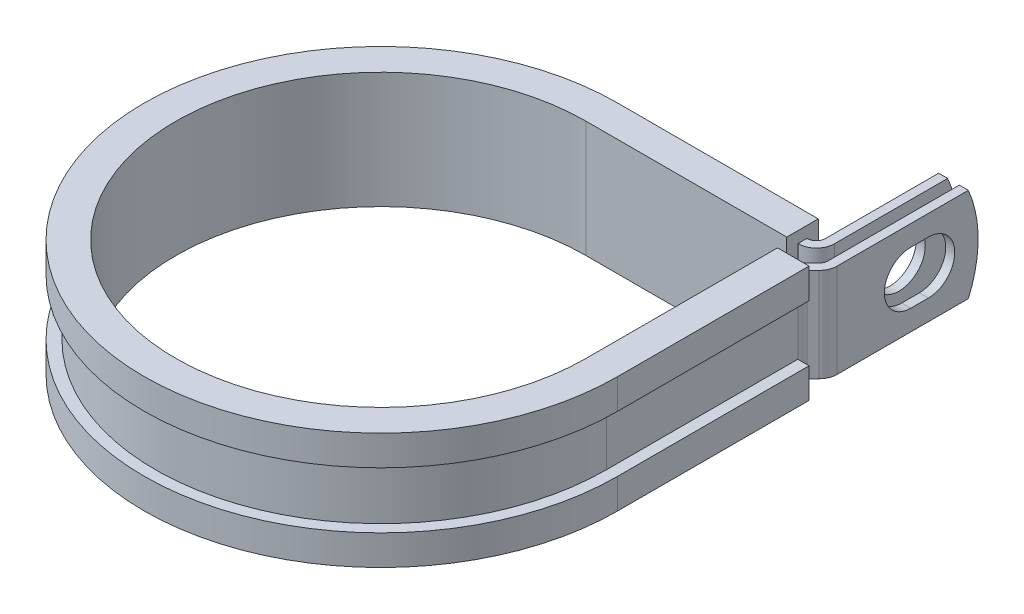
ISO-10303-21;
HEADER;
FILE_DESCRIPTION(('STEP AP214'),'2;1');
FILE_NAME('part.step','',(''),(''),'','','');
FILE_SCHEMA(('AUTOMOTIVE_DESIGN { 1 0 10303 214 1 1 1 1 }'));
ENDSEC;
DATA;
#1=APPLICATION_CONTEXT('core data for automotive mechanical design processes');
#2=APPLICATION_PROTOCOL_DEFINITION('international standard','automotive_design',2000,#1);
#3=PRODUCT_CONTEXT('',#1,'mechanical');
#4=PRODUCT('Part','Part','',(#3));
#5=PRODUCT_RELATED_PRODUCT_CATEGORY('part','',(#4));
#6=PRODUCT_DEFINITION_FORMATION('','',#4);
#7=PRODUCT_DEFINITION_CONTEXT('part definition',#1,'design');
#8=PRODUCT_DEFINITION('design','',#6,#7);
#9=PRODUCT_DEFINITION_SHAPE('','',#8);
#10=(LENGTH_UNIT() NAMED_UNIT(*) SI_UNIT(.MILLI.,.METRE.));
#11=(NAMED_UNIT(*) PLANE_ANGLE_UNIT() SI_UNIT($,.RADIAN.));
#12=(NAMED_UNIT(*) SI_UNIT($,.STERADIAN.) SOLID_ANGLE_UNIT());
#13=UNCERTAINTY_MEASURE_WITH_UNIT(LENGTH_MEASURE(1.E-05),#10,'distance_accuracy_value','');
#14=(GEOMETRIC_REPRESENTATION_CONTEXT(3) GLOBAL_UNCERTAINTY_ASSIGNED_CONTEXT((#13)) GLOBAL_UNIT_ASSIGNED_CONTEXT((#10,
#11,#12)) REPRESENTATION_CONTEXT('',''));
#15=CARTESIAN_POINT('',(0.,0.,0.));
#16=DIRECTION('',(0.,0.,1.));
#17=DIRECTION('',(1.,0.,0.));
#18=AXIS2_PLACEMENT_3D('',#15,#16,#17);
#19=CARTESIAN_POINT('',(29.9771698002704,-6.35,-29.2989));
#20=DIRECTION('',(0.,1.,0.));
#21=DIRECTION('',(1.,0.,0.));
#22=AXIS2_PLACEMENT_3D('',#19,#20,#21);
#23=PLANE('',#22);
#24=DIRECTION('',(0.,0.,-1.));
#25=VECTOR('',#24,1.);
#26=CARTESIAN_POINT('',(27.1323698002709,-6.35,-29.2989));
#27=LINE('',#26,#25);
#28=CARTESIAN_POINT('',(27.1323698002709,-6.35,-29.2989));
#29=VERTEX_POINT('',#28);
#30=CARTESIAN_POINT('',(27.1323698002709,-6.35,-30.5181));
#31=VERTEX_POINT('',#30);
#32=EDGE_CURVE('E524',#29,#31,#27,.T.);
#33=ORIENTED_EDGE('',*,*,#32,.T.);
#34=DIRECTION('',(-1.,0.,0.));
#35=VECTOR('',#34,1.);
#36=CARTESIAN_POINT('',(0.,-6.35,-30.5181));
#37=LINE('',#36,#35);
#38=CARTESIAN_POINT('',(27.1831698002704,-6.35,-30.5181));
#39=VERTEX_POINT('',#38);
#40=EDGE_CURVE('E411',#39,#31,#37,.T.);
#41=ORIENTED_EDGE('',*,*,#40,.F.);
#42=CARTESIAN_POINT('',(27.1831698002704,-6.35,-31.7373));
#43=DIRECTION('',(0.,1.,0.));
#44=DIRECTION('',(1.,0.,0.));
#45=AXIS2_PLACEMENT_3D('',#42,#43,#44);
#46=CIRCLE('',#45,1.2192);
#47=CARTESIAN_POINT('',(28.4023698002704,-6.35,-31.7373));
#48=VERTEX_POINT('',#47);
#49=EDGE_CURVE('E409',#48,#39,#46,.F.);
#50=ORIENTED_EDGE('',*,*,#49,.F.);
#51=DIRECTION('',(0.,0.,1.));
#52=VECTOR('',#51,1.);
#53=CARTESIAN_POINT('',(28.4023698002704,-6.35,-48.387));
#54=LINE('',#53,#52);
#55=CARTESIAN_POINT('',(28.4023698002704,-6.35,-47.0616778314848));
#56=VERTEX_POINT('',#55);
#57=EDGE_CURVE('E407',#56,#48,#54,.T.);
#58=ORIENTED_EDGE('',*,*,#57,.F.);
#59=DIRECTION('',(-1.,0.,0.));
#60=VECTOR('',#59,1.);
#61=CARTESIAN_POINT('',(32.4155698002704,-6.35,-47.0616778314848));
#62=LINE('',#61,#60);
#63=CARTESIAN_POINT('',(29.6215698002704,-6.35,-47.0616778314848));
#64=VERTEX_POINT('',#63);
#65=EDGE_CURVE('E12',#64,#56,#62,.T.);
#66=ORIENTED_EDGE('',*,*,#65,.F.);
#67=DIRECTION('',(0.,0.,1.));
#68=VECTOR('',#67,1.);
#69=CARTESIAN_POINT('',(29.6215698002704,-6.35,-48.387));
#70=LINE('',#69,#68);
#71=CARTESIAN_POINT('',(29.6215698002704,-6.35,-31.7373));
#72=VERTEX_POINT('',#71);
#73=EDGE_CURVE('E405',#64,#72,#70,.T.);
#74=ORIENTED_EDGE('',*,*,#73,.T.);
#75=CARTESIAN_POINT('',(27.1831698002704,-6.35,-31.7373));
#76=DIRECTION('',(0.,-1.,0.));
#77=DIRECTION('',(0.,0.,1.));
#78=AXIS2_PLACEMENT_3D('',#75,#76,#77);
#79=CIRCLE('',#78,2.4384);
#80=CARTESIAN_POINT('',(27.1831698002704,-6.35,-29.2989));
#81=VERTEX_POINT('',#80);
#82=EDGE_CURVE('E402',#72,#81,#79,.T.);
#83=ORIENTED_EDGE('',*,*,#82,.T.);
#84=DIRECTION('',(-1.,0.,0.));
#85=VECTOR('',#84,1.);
#86=CARTESIAN_POINT('',(0.,-6.35,-29.2989));
#87=LINE('',#86,#85);
#88=EDGE_CURVE('E399',#81,#29,#87,.T.);
#89=ORIENTED_EDGE('',*,*,#88,.T.);
#90=EDGE_LOOP('',(#33,#41,#50,#58,#66,#74,#83,#89));
#91=FACE_BOUND('',#90,.T.);
#92=ADVANCED_FACE('F55',(#91),#23,.F.);
#93=CARTESIAN_POINT('',(29.9771698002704,6.35,-29.2989));
#94=DIRECTION('',(0.,1.,0.));
#95=DIRECTION('',(1.,0.,0.));
#96=AXIS2_PLACEMENT_3D('',#93,#94,#95);
#97=PLANE('',#96);
#98=DIRECTION('',(-1.,0.,0.));
#99=VECTOR('',#98,1.);
#100=CARTESIAN_POINT('',(0.,6.35,-30.5181));
#101=LINE('',#100,#99);
#102=CARTESIAN_POINT('',(27.1831698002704,6.35,-30.5181));
#103=VERTEX_POINT('',#102);
#104=CARTESIAN_POINT('',(27.1323698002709,6.35,-30.5181));
#105=VERTEX_POINT('',#104);
#106=EDGE_CURVE('E369',#103,#105,#101,.T.);
#107=ORIENTED_EDGE('',*,*,#106,.T.);
#108=DIRECTION('',(0.,0.,1.));
#109=VECTOR('',#108,1.);
#110=CARTESIAN_POINT('',(27.1323698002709,6.35,-30.5181));
#111=LINE('',#110,#109);
#112=CARTESIAN_POINT('',(27.1323698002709,6.35,-29.2989));
#113=VERTEX_POINT('',#112);
#114=EDGE_CURVE('E518',#105,#113,#111,.T.);
#115=ORIENTED_EDGE('',*,*,#114,.T.);
#116=DIRECTION('',(-1.,0.,0.));
#117=VECTOR('',#116,1.);
#118=CARTESIAN_POINT('',(0.,6.35,-29.2989));
#119=LINE('',#118,#117);
#120=CARTESIAN_POINT('',(27.1831698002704,6.35,-29.2989));
#121=VERTEX_POINT('',#120);
#122=EDGE_CURVE('E626',#121,#113,#119,.T.);
#123=ORIENTED_EDGE('',*,*,#122,.F.);
#124=CARTESIAN_POINT('',(27.1831698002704,6.35,-31.7373));
#125=DIRECTION('',(0.,-1.,0.));
#126=DIRECTION('',(0.,0.,1.));
#127=AXIS2_PLACEMENT_3D('',#124,#125,#126);
#128=CIRCLE('',#127,2.4384);
#129=CARTESIAN_POINT('',(29.6215698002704,6.35,-31.7373));
#130=VERTEX_POINT('',#129);
#131=EDGE_CURVE('E371',#130,#121,#128,.T.);
#132=ORIENTED_EDGE('',*,*,#131,.F.);
#133=DIRECTION('',(0.,0.,1.));
#134=VECTOR('',#133,1.);
#135=CARTESIAN_POINT('',(29.6215698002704,6.35,-48.387));
#136=LINE('',#135,#134);
#137=CARTESIAN_POINT('',(29.6215698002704,6.35,-47.0616778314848));
#138=VERTEX_POINT('',#137);
#139=EDGE_CURVE('E362',#138,#130,#136,.T.);
#140=ORIENTED_EDGE('',*,*,#139,.F.);
#141=DIRECTION('',(-1.,0.,0.));
#142=VECTOR('',#141,1.);
#143=CARTESIAN_POINT('',(32.4155698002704,6.35,-47.0616778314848));
#144=LINE('',#143,#142);
#145=CARTESIAN_POINT('',(28.4023698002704,6.35,-47.0616778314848));
#146=VERTEX_POINT('',#145);
#147=EDGE_CURVE('E63',#138,#146,#144,.T.);
#148=ORIENTED_EDGE('',*,*,#147,.T.);
#149=DIRECTION('',(0.,0.,1.));
#150=VECTOR('',#149,1.);
#151=CARTESIAN_POINT('',(28.4023698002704,6.35,-48.387));
#152=LINE('',#151,#150);
#153=CARTESIAN_POINT('',(28.4023698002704,6.35,-31.7373));
#154=VERTEX_POINT('',#153);
#155=EDGE_CURVE('E359',#146,#154,#152,.T.);
#156=ORIENTED_EDGE('',*,*,#155,.T.);
#157=CARTESIAN_POINT('',(27.1831698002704,6.35,-31.7373));
#158=DIRECTION('',(0.,1.,0.));
#159=DIRECTION('',(1.,0.,0.));
#160=AXIS2_PLACEMENT_3D('',#157,#158,#159);
#161=CIRCLE('',#160,1.2192);
#162=EDGE_CURVE('E367',#154,#103,#161,.F.);
#163=ORIENTED_EDGE('',*,*,#162,.T.);
#164=EDGE_LOOP('',(#107,#115,#123,#132,#140,#148,#156,#163));
#165=FACE_BOUND('',#164,.T.);
#166=ADVANCED_FACE('F358',(#165),#97,.T.);
#167=CARTESIAN_POINT('',(0.,6.35,-29.2989));
#168=DIRECTION('',(0.,0.,1.));
#169=DIRECTION('',(1.,0.,0.));
#170=AXIS2_PLACEMENT_3D('',#167,#168,#169);
#171=PLANE('',#170);
#172=ORIENTED_EDGE('',*,*,#122,.T.);
#173=DIRECTION('',(0.,-1.,0.));
#174=VECTOR('',#173,1.);
#175=CARTESIAN_POINT('',(27.1323698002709,6.35,-29.2989));
#176=LINE('',#175,#174);
#177=EDGE_CURVE('E521',#113,#29,#176,.T.);
#178=ORIENTED_EDGE('',*,*,#177,.T.);
#179=ORIENTED_EDGE('',*,*,#88,.F.);
#180=DIRECTION('',(0.,-1.,0.));
#181=VECTOR('',#180,1.);
#182=CARTESIAN_POINT('',(27.1831698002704,6.35,-29.2989));
#183=LINE('',#182,#181);
#184=EDGE_CURVE('E345',#121,#81,#183,.T.);
#185=ORIENTED_EDGE('',*,*,#184,.F.);
#186=EDGE_LOOP('',(#172,#178,#179,#185));
#187=FACE_BOUND('',#186,.T.);
#188=ADVANCED_FACE('F636',(#187),#171,.T.);
#189=CARTESIAN_POINT('',(32.4155698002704,6.35,-29.2989));
#190=DIRECTION('',(-1.,0.,0.));
#191=DIRECTION('',(0.,0.,1.));
#192=AXIS2_PLACEMENT_3D('',#189,#190,#191);
#193=PLANE('',#192);
#194=CARTESIAN_POINT('',(32.4155698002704,0.,-41.6559999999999));
#195=DIRECTION('',(1.,0.,0.));
#196=DIRECTION('',(0.,0.,-1.));
#197=AXIS2_PLACEMENT_3D('',#194,#195,#196);
#198=CIRCLE('',#197,3.5687);
#199=CARTESIAN_POINT('',(32.4155698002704,-3.5687,-41.6560000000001));
#200=VERTEX_POINT('',#199);
#201=CARTESIAN_POINT('',(32.4155698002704,3.5687,-41.6560000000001));
#202=VERTEX_POINT('',#201);
#203=EDGE_CURVE('E581',#200,#202,#198,.T.);
#204=ORIENTED_EDGE('',*,*,#203,.F.);
#205=DIRECTION('',(0.,0.,-1.));
#206=VECTOR('',#205,1.);
#207=CARTESIAN_POINT('',(32.4155698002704,-3.5687,-39.2683999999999));
#208=LINE('',#207,#206);
#209=CARTESIAN_POINT('',(32.4155698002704,-3.5687,-39.2683999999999));
#210=VERTEX_POINT('',#209);
#211=EDGE_CURVE('E584',#210,#200,#208,.T.);
#212=ORIENTED_EDGE('',*,*,#211,.F.);
#213=CARTESIAN_POINT('',(32.4155698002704,0.,-39.2683999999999));
#214=DIRECTION('',(1.,0.,0.));
#215=DIRECTION('',(0.,0.,-1.));
#216=AXIS2_PLACEMENT_3D('',#213,#214,#215);
#217=CIRCLE('',#216,3.5687);
#218=CARTESIAN_POINT('',(32.4155698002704,3.5687,-39.2683999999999));
#219=VERTEX_POINT('',#218);
#220=EDGE_CURVE('E577',#219,#210,#217,.T.);
#221=ORIENTED_EDGE('',*,*,#220,.F.);
#222=DIRECTION('',(0.,0.,1.));
#223=VECTOR('',#222,1.);
#224=CARTESIAN_POINT('',(32.4155698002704,3.5687,-39.2683999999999));
#225=LINE('',#224,#223);
#226=EDGE_CURVE('E578',#202,#219,#225,.T.);
#227=ORIENTED_EDGE('',*,*,#226,.F.);
#228=EDGE_LOOP('',(#204,#212,#221,#227));
#229=FACE_BOUND('',#228,.T.);
#230=DIRECTION('',(0.,0.,-1.));
#231=VECTOR('',#230,1.);
#232=CARTESIAN_POINT('',(32.4155698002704,-6.35,-29.2989));
#233=LINE('',#232,#231);
#234=CARTESIAN_POINT('',(32.4155698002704,-6.35,-29.2989));
#235=VERTEX_POINT('',#234);
#236=CARTESIAN_POINT('',(32.4155698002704,-6.35,-47.0616778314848));
#237=VERTEX_POINT('',#236);
#238=EDGE_CURVE('E383',#235,#237,#233,.T.);
#239=ORIENTED_EDGE('',*,*,#238,.T.);
#240=CARTESIAN_POINT('',(32.4155698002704,0.,-32.512));
#241=DIRECTION('',(-1.,0.,0.));
#242=DIRECTION('',(0.,0.,1.));
#243=AXIS2_PLACEMENT_3D('',#240,#241,#242);
#244=CIRCLE('',#243,15.875);
#245=CARTESIAN_POINT('',(32.4155698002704,6.35,-47.0616778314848));
#246=VERTEX_POINT('',#245);
#247=EDGE_CURVE('E569',#246,#237,#244,.T.);
#248=ORIENTED_EDGE('',*,*,#247,.F.);
#249=DIRECTION('',(0.,0.,-1.));
#250=VECTOR('',#249,1.);
#251=CARTESIAN_POINT('',(32.4155698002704,6.35,-29.2989));
#252=LINE('',#251,#250);
#253=CARTESIAN_POINT('',(32.4155698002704,6.35,-29.2989));
#254=VERTEX_POINT('',#253);
#255=EDGE_CURVE('E420',#254,#246,#252,.T.);
#256=ORIENTED_EDGE('',*,*,#255,.F.);
#257=DIRECTION('',(0.,-1.,0.));
#258=VECTOR('',#257,1.);
#259=CARTESIAN_POINT('',(32.4155698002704,6.35,-29.2989));
#260=LINE('',#259,#258);
#261=EDGE_CURVE('E382',#254,#235,#260,.T.);
#262=ORIENTED_EDGE('',*,*,#261,.T.);
#263=EDGE_LOOP('',(#239,#248,#256,#262));
#264=FACE_BOUND('',#263,.T.);
#265=ADVANCED_FACE('F57',(#229,#264),#193,.F.);
#266=CARTESIAN_POINT('',(31.1963698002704,6.35,-29.2989));
#267=DIRECTION('',(-1.,0.,0.));
#268=DIRECTION('',(0.,0.,1.));
#269=AXIS2_PLACEMENT_3D('',#266,#267,#268);
#270=PLANE('',#269);
#271=DIRECTION('',(0.,0.,-1.));
#272=VECTOR('',#271,1.);
#273=CARTESIAN_POINT('',(31.1963698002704,-3.5687,-39.2683999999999));
#274=LINE('',#273,#272);
#275=CARTESIAN_POINT('',(31.1963698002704,-3.5687,-39.2683999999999));
#276=VERTEX_POINT('',#275);
#277=CARTESIAN_POINT('',(31.1963698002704,-3.5687,-41.6560000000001));
#278=VERTEX_POINT('',#277);
#279=EDGE_CURVE('E580',#276,#278,#274,.T.);
#280=ORIENTED_EDGE('',*,*,#279,.T.);
#281=CARTESIAN_POINT('',(31.1963698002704,0.,-41.6559999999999));
#282=DIRECTION('',(-1.,0.,0.));
#283=DIRECTION('',(0.,0.,1.));
#284=AXIS2_PLACEMENT_3D('',#281,#282,#283);
#285=CIRCLE('',#284,3.5687);
#286=CARTESIAN_POINT('',(31.1963698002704,3.5687,-41.6560000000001));
#287=VERTEX_POINT('',#286);
#288=EDGE_CURVE('E601',#278,#287,#285,.F.);
#289=ORIENTED_EDGE('',*,*,#288,.T.);
#290=DIRECTION('',(0.,0.,1.));
#291=VECTOR('',#290,1.);
#292=CARTESIAN_POINT('',(31.1963698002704,3.5687,-39.2683999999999));
#293=LINE('',#292,#291);
#294=CARTESIAN_POINT('',(31.1963698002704,3.5687,-39.2683999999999));
#295=VERTEX_POINT('',#294);
#296=EDGE_CURVE('E597',#287,#295,#293,.T.);
#297=ORIENTED_EDGE('',*,*,#296,.T.);
#298=CARTESIAN_POINT('',(31.1963698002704,0.,-39.2683999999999));
#299=DIRECTION('',(-1.,0.,0.));
#300=DIRECTION('',(0.,0.,1.));
#301=AXIS2_PLACEMENT_3D('',#298,#299,#300);
#302=CIRCLE('',#301,3.5687);
#303=EDGE_CURVE('E592',#295,#276,#302,.F.);
#304=ORIENTED_EDGE('',*,*,#303,.T.);
#305=EDGE_LOOP('',(#280,#289,#297,#304));
#306=FACE_BOUND('',#305,.T.);
#307=CARTESIAN_POINT('',(31.1963698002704,0.,-32.512));
#308=DIRECTION('',(-1.,0.,0.));
#309=DIRECTION('',(0.,0.,1.));
#310=AXIS2_PLACEMENT_3D('',#307,#308,#309);
#311=CIRCLE('',#310,15.875);
#312=CARTESIAN_POINT('',(31.1963698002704,6.35,-47.0616778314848));
#313=VERTEX_POINT('',#312);
#314=CARTESIAN_POINT('',(31.1963698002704,-6.35,-47.0616778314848));
#315=VERTEX_POINT('',#314);
#316=EDGE_CURVE('E77',#313,#315,#311,.T.);
#317=ORIENTED_EDGE('',*,*,#316,.T.);
#318=DIRECTION('',(0.,0.,-1.));
#319=VECTOR('',#318,1.);
#320=CARTESIAN_POINT('',(31.1963698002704,-6.35,-29.2989));
#321=LINE('',#320,#319);
#322=CARTESIAN_POINT('',(31.1963698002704,-6.35,-29.2989));
#323=VERTEX_POINT('',#322);
#324=EDGE_CURVE('E386',#323,#315,#321,.T.);
#325=ORIENTED_EDGE('',*,*,#324,.F.);
#326=DIRECTION('',(0.,-1.,0.));
#327=VECTOR('',#326,1.);
#328=CARTESIAN_POINT('',(31.1963698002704,6.35,-29.2989));
#329=LINE('',#328,#327);
#330=CARTESIAN_POINT('',(31.1963698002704,6.35,-29.2989));
#331=VERTEX_POINT('',#330);
#332=EDGE_CURVE('E353',#331,#323,#329,.T.);
#333=ORIENTED_EDGE('',*,*,#332,.F.);
#334=DIRECTION('',(0.,0.,-1.));
#335=VECTOR('',#334,1.);
#336=CARTESIAN_POINT('',(31.1963698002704,6.35,-29.2989));
#337=LINE('',#336,#335);
#338=EDGE_CURVE('E616',#331,#313,#337,.T.);
#339=ORIENTED_EDGE('',*,*,#338,.T.);
#340=EDGE_LOOP('',(#317,#325,#333,#339));
#341=FACE_BOUND('',#340,.T.);
#342=ADVANCED_FACE('F690',(#306,#341),#270,.T.);
#343=CARTESIAN_POINT('',(29.6215698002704,6.35,-48.387));
#344=DIRECTION('',(1.,0.,0.));
#345=DIRECTION('',(0.,0.,-1.));
#346=AXIS2_PLACEMENT_3D('',#343,#344,#345);
#347=PLANE('',#346);
#348=CARTESIAN_POINT('',(29.6215698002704,0.,-40.4622));
#349=DIRECTION('',(1.,0.,0.));
#350=DIRECTION('',(0.,0.,-1.));
#351=AXIS2_PLACEMENT_3D('',#348,#349,#350);
#352=CIRCLE('',#351,3.5687);
#353=CARTESIAN_POINT('',(29.6215698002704,0.,-44.0309));
#354=VERTEX_POINT('',#353);
#355=EDGE_CURVE('E387',#354,#354,#352,.F.);
#356=ORIENTED_EDGE('',*,*,#355,.T.);
#357=EDGE_LOOP('',(#356));
#358=FACE_BOUND('',#357,.T.);
#359=ORIENTED_EDGE('',*,*,#73,.F.);
#360=CARTESIAN_POINT('',(29.6215698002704,0.,-32.512));
#361=DIRECTION('',(1.,0.,0.));
#362=DIRECTION('',(0.,0.,-1.));
#363=AXIS2_PLACEMENT_3D('',#360,#361,#362);
#364=CIRCLE('',#363,15.875);
#365=EDGE_CURVE('E574',#64,#138,#364,.T.);
#366=ORIENTED_EDGE('',*,*,#365,.T.);
#367=ORIENTED_EDGE('',*,*,#139,.T.);
#368=DIRECTION('',(0.,-1.,0.));
#369=VECTOR('',#368,1.);
#370=CARTESIAN_POINT('',(29.6215698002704,6.35,-31.7373));
#371=LINE('',#370,#369);
#372=EDGE_CURVE('E342',#130,#72,#371,.T.);
#373=ORIENTED_EDGE('',*,*,#372,.T.);
#374=EDGE_LOOP('',(#359,#366,#367,#373));
#375=FACE_BOUND('',#374,.T.);
#376=ADVANCED_FACE('F642',(#358,#375),#347,.T.);
#377=CARTESIAN_POINT('',(28.4023698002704,6.35,-48.387));
#378=DIRECTION('',(1.,0.,0.));
#379=DIRECTION('',(0.,0.,-1.));
#380=AXIS2_PLACEMENT_3D('',#377,#378,#379);
#381=PLANE('',#380);
#382=CARTESIAN_POINT('',(28.4023698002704,0.,-40.4622));
#383=DIRECTION('',(-1.,0.,0.));
#384=DIRECTION('',(0.,0.,1.));
#385=AXIS2_PLACEMENT_3D('',#382,#383,#384);
#386=CIRCLE('',#385,3.5687);
#387=CARTESIAN_POINT('',(28.4023698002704,0.,-36.8935));
#388=VERTEX_POINT('',#387);
#389=EDGE_CURVE('E609',#388,#388,#386,.T.);
#390=ORIENTED_EDGE('',*,*,#389,.F.);
#391=EDGE_LOOP('',(#390));
#392=FACE_BOUND('',#391,.T.);
#393=CARTESIAN_POINT('',(28.4023698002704,0.,-32.512));
#394=DIRECTION('',(-1.,0.,0.));
#395=DIRECTION('',(0.,0.,1.));
#396=AXIS2_PLACEMENT_3D('',#393,#394,#395);
#397=CIRCLE('',#396,15.875);
#398=EDGE_CURVE('E69',#146,#56,#397,.T.);
#399=ORIENTED_EDGE('',*,*,#398,.T.);
#400=ORIENTED_EDGE('',*,*,#57,.T.);
#401=DIRECTION('',(0.,-1.,0.));
#402=VECTOR('',#401,1.);
#403=CARTESIAN_POINT('',(28.4023698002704,6.35,-31.7373));
#404=LINE('',#403,#402);
#405=EDGE_CURVE('E339',#154,#48,#404,.T.);
#406=ORIENTED_EDGE('',*,*,#405,.F.);
#407=ORIENTED_EDGE('',*,*,#155,.F.);
#408=EDGE_LOOP('',(#399,#400,#406,#407));
#409=FACE_BOUND('',#408,.T.);
#410=ADVANCED_FACE('F365',(#392,#409),#381,.F.);
#411=CARTESIAN_POINT('',(31.7373,-6.35,-25.8864026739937));
#412=DIRECTION('',(0.,1.,0.));
#413=DIRECTION('',(1.,0.,0.));
#414=AXIS2_PLACEMENT_3D('',#411,#412,#413);
#415=CIRCLE('',#414,1.2192);
#416=CARTESIAN_POINT('',(30.5181,-6.35,-25.8864026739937));
#417=VERTEX_POINT('',#416);
#418=CARTESIAN_POINT('',(30.8751954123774,-6.35,-26.7485072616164));
#419=VERTEX_POINT('',#418);
#420=EDGE_CURVE('E414',#417,#419,#415,.F.);
#421=ORIENTED_EDGE('',*,*,#420,.F.);
#422=DIRECTION('',(1.,0.,0.));
#423=VECTOR('',#422,1.);
#424=CARTESIAN_POINT('',(29.2989,-6.35,-25.8864026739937));
#425=LINE('',#424,#423);
#426=CARTESIAN_POINT('',(29.2989,-6.35,-25.8864026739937));
#427=VERTEX_POINT('',#426);
#428=EDGE_CURVE('E452',#427,#417,#425,.T.);
#429=ORIENTED_EDGE('',*,*,#428,.F.);
#430=CARTESIAN_POINT('',(31.7373,-6.35,-25.8864026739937));
#431=DIRECTION('',(0.,-1.,0.));
#432=DIRECTION('',(0.,0.,1.));
#433=AXIS2_PLACEMENT_3D('',#430,#431,#432);
#434=CIRCLE('',#433,2.4384);
#435=CARTESIAN_POINT('',(30.0130908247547,-6.35,-27.610611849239));
#436=VERTEX_POINT('',#435);
#437=EDGE_CURVE('E396',#427,#436,#434,.T.);
#438=ORIENTED_EDGE('',*,*,#437,.T.);
#439=DIRECTION('',(0.707106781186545,0.,-0.70710678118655));
#440=VECTOR('',#439,1.);
#441=CARTESIAN_POINT('',(30.0130908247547,-6.35,-27.610611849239));
#442=LINE('',#441,#440);
#443=CARTESIAN_POINT('',(30.8392743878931,-6.35,-28.4367954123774));
#444=VERTEX_POINT('',#443);
#445=EDGE_CURVE('E393',#436,#444,#442,.T.);
#446=ORIENTED_EDGE('',*,*,#445,.T.);
#447=CARTESIAN_POINT('',(29.9771698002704,-6.35,-29.2989));
#448=DIRECTION('',(0.,1.,0.));
#449=DIRECTION('',(0.,0.,1.));
#450=AXIS2_PLACEMENT_3D('',#447,#448,#449);
#451=CIRCLE('',#450,1.2192);
#452=EDGE_CURVE('E390',#444,#323,#451,.T.);
#453=ORIENTED_EDGE('',*,*,#452,.T.);
#454=ORIENTED_EDGE('',*,*,#324,.T.);
#455=DIRECTION('',(-1.,0.,0.));
#456=VECTOR('',#455,1.);
#457=CARTESIAN_POINT('',(32.4155698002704,-6.35,-47.0616778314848));
#458=LINE('',#457,#456);
#459=EDGE_CURVE('E567',#237,#315,#458,.T.);
#460=ORIENTED_EDGE('',*,*,#459,.F.);
#461=ORIENTED_EDGE('',*,*,#238,.F.);
#462=CARTESIAN_POINT('',(29.9771698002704,-6.35,-29.2989));
#463=DIRECTION('',(0.,1.,0.));
#464=DIRECTION('',(1.,0.,0.));
#465=AXIS2_PLACEMENT_3D('',#462,#463,#464);
#466=CIRCLE('',#465,2.4384);
#467=CARTESIAN_POINT('',(31.7013789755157,-6.35,-27.5746908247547));
#468=VERTEX_POINT('',#467);
#469=EDGE_CURVE('E418',#468,#235,#466,.T.);
#470=ORIENTED_EDGE('',*,*,#469,.F.);
#471=DIRECTION('',(0.707106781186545,0.,-0.70710678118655));
#472=VECTOR('',#471,1.);
#473=CARTESIAN_POINT('',(30.8751954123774,-6.35,-26.7485072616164));
#474=LINE('',#473,#472);
#475=EDGE_CURVE('E416',#419,#468,#474,.T.);
#476=ORIENTED_EDGE('',*,*,#475,.F.);
#477=EDGE_LOOP('',(#421,#429,#438,#446,#453,#454,#460,#461,#470,#476));
#478=FACE_BOUND('',#477,.T.);
#479=ADVANCED_FACE('F676',(#478),#23,.F.);
#480=DIRECTION('',(-1.,0.,0.));
#481=VECTOR('',#480,1.);
#482=CARTESIAN_POINT('',(30.5181,6.35,-25.8864026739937));
#483=LINE('',#482,#481);
#484=CARTESIAN_POINT('',(30.5181,6.35,-25.8864026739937));
#485=VERTEX_POINT('',#484);
#486=CARTESIAN_POINT('',(29.2989,6.35,-25.8864026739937));
#487=VERTEX_POINT('',#486);
#488=EDGE_CURVE('E441',#485,#487,#483,.T.);
#489=ORIENTED_EDGE('',*,*,#488,.F.);
#490=CARTESIAN_POINT('',(31.7373,6.35,-25.8864026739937));
#491=DIRECTION('',(0.,1.,0.));
#492=DIRECTION('',(1.,0.,0.));
#493=AXIS2_PLACEMENT_3D('',#490,#491,#492);
#494=CIRCLE('',#493,1.2192);
#495=CARTESIAN_POINT('',(30.8751954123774,6.35,-26.7485072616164));
#496=VERTEX_POINT('',#495);
#497=EDGE_CURVE('E376',#485,#496,#494,.F.);
#498=ORIENTED_EDGE('',*,*,#497,.T.);
#499=DIRECTION('',(0.707106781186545,0.,-0.70710678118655));
#500=VECTOR('',#499,1.);
#501=CARTESIAN_POINT('',(30.8751954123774,6.35,-26.7485072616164));
#502=LINE('',#501,#500);
#503=CARTESIAN_POINT('',(31.7013789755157,6.35,-27.5746908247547));
#504=VERTEX_POINT('',#503);
#505=EDGE_CURVE('E378',#496,#504,#502,.T.);
#506=ORIENTED_EDGE('',*,*,#505,.T.);
#507=CARTESIAN_POINT('',(29.9771698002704,6.35,-29.2989));
#508=DIRECTION('',(0.,1.,0.));
#509=DIRECTION('',(1.,0.,0.));
#510=AXIS2_PLACEMENT_3D('',#507,#508,#509);
#511=CIRCLE('',#510,2.4384);
#512=EDGE_CURVE('E380',#504,#254,#511,.T.);
#513=ORIENTED_EDGE('',*,*,#512,.T.);
#514=ORIENTED_EDGE('',*,*,#255,.T.);
#515=DIRECTION('',(-1.,0.,0.));
#516=VECTOR('',#515,1.);
#517=CARTESIAN_POINT('',(32.4155698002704,6.35,-47.0616778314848));
#518=LINE('',#517,#516);
#519=EDGE_CURVE('E571',#246,#313,#518,.T.);
#520=ORIENTED_EDGE('',*,*,#519,.T.);
#521=ORIENTED_EDGE('',*,*,#338,.F.);
#522=CARTESIAN_POINT('',(29.9771698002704,6.35,-29.2989));
#523=DIRECTION('',(0.,1.,0.));
#524=DIRECTION('',(0.,0.,1.));
#525=AXIS2_PLACEMENT_3D('',#522,#523,#524);
#526=CIRCLE('',#525,1.2192);
#527=CARTESIAN_POINT('',(30.8392743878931,6.35,-28.4367954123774));
#528=VERTEX_POINT('',#527);
#529=EDGE_CURVE('E619',#528,#331,#526,.T.);
#530=ORIENTED_EDGE('',*,*,#529,.F.);
#531=DIRECTION('',(0.707106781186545,0.,-0.70710678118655));
#532=VECTOR('',#531,1.);
#533=CARTESIAN_POINT('',(30.0130908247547,6.35,-27.610611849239));
#534=LINE('',#533,#532);
#535=CARTESIAN_POINT('',(30.0130908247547,6.35,-27.610611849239));
#536=VERTEX_POINT('',#535);
#537=EDGE_CURVE('E622',#536,#528,#534,.T.);
#538=ORIENTED_EDGE('',*,*,#537,.F.);
#539=CARTESIAN_POINT('',(31.7373,6.35,-25.8864026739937));
#540=DIRECTION('',(0.,-1.,0.));
#541=DIRECTION('',(0.,0.,1.));
#542=AXIS2_PLACEMENT_3D('',#539,#540,#541);
#543=CIRCLE('',#542,2.4384);
#544=EDGE_CURVE('E451',#487,#536,#543,.T.);
#545=ORIENTED_EDGE('',*,*,#544,.F.);
#546=EDGE_LOOP('',(#489,#498,#506,#513,#514,#520,#521,#530,#538,#545));
#547=FACE_BOUND('',#546,.T.);
#548=ADVANCED_FACE('F448',(#547),#97,.T.);
#549=CARTESIAN_POINT('',(29.9771698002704,6.35,-29.2989));
#550=DIRECTION('',(0.,-1.,0.));
#551=DIRECTION('',(0.,0.,-1.));
#552=AXIS2_PLACEMENT_3D('',#549,#550,#551);
#553=CYLINDRICAL_SURFACE('',#552,1.2192);
#554=ORIENTED_EDGE('',*,*,#452,.F.);
#555=DIRECTION('',(0.,-1.,0.));
#556=VECTOR('',#555,1.);
#557=CARTESIAN_POINT('',(30.8392743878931,6.35,-28.4367954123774));
#558=LINE('',#557,#556);
#559=EDGE_CURVE('E351',#528,#444,#558,.T.);
#560=ORIENTED_EDGE('',*,*,#559,.F.);
#561=ORIENTED_EDGE('',*,*,#529,.T.);
#562=ORIENTED_EDGE('',*,*,#332,.T.);
#563=EDGE_LOOP('',(#554,#560,#561,#562));
#564=FACE_BOUND('',#563,.T.);
#565=ADVANCED_FACE('F686',(#564),#553,.F.);
#566=CARTESIAN_POINT('',(30.0130908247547,6.35,-27.610611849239));
#567=DIRECTION('',(-0.70710678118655,0.,-0.707106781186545));
#568=DIRECTION('',(-0.707106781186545,0.,0.70710678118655));
#569=AXIS2_PLACEMENT_3D('',#566,#567,#568);
#570=PLANE('',#569);
#571=ORIENTED_EDGE('',*,*,#445,.F.);
#572=DIRECTION('',(0.,-1.,0.));
#573=VECTOR('',#572,1.);
#574=CARTESIAN_POINT('',(30.0130908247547,6.35,-27.610611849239));
#575=LINE('',#574,#573);
#576=EDGE_CURVE('E349',#536,#436,#575,.T.);
#577=ORIENTED_EDGE('',*,*,#576,.F.);
#578=ORIENTED_EDGE('',*,*,#537,.T.);
#579=ORIENTED_EDGE('',*,*,#559,.T.);
#580=EDGE_LOOP('',(#571,#577,#578,#579));
#581=FACE_BOUND('',#580,.T.);
#582=ADVANCED_FACE('F681',(#581),#570,.T.);
#583=CARTESIAN_POINT('',(31.7373,6.35,-25.8864026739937));
#584=DIRECTION('',(0.,-1.,0.));
#585=DIRECTION('',(0.,0.,-1.));
#586=AXIS2_PLACEMENT_3D('',#583,#584,#585);
#587=CYLINDRICAL_SURFACE('',#586,2.4384);
#588=ORIENTED_EDGE('',*,*,#437,.F.);
#589=DIRECTION('',(0.,-1.,0.));
#590=VECTOR('',#589,1.);
#591=CARTESIAN_POINT('',(29.2989,6.35,-25.8864026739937));
#592=LINE('',#591,#590);
#593=EDGE_CURVE('E347',#487,#427,#592,.T.);
#594=ORIENTED_EDGE('',*,*,#593,.F.);
#595=ORIENTED_EDGE('',*,*,#544,.T.);
#596=ORIENTED_EDGE('',*,*,#576,.T.);
#597=EDGE_LOOP('',(#588,#594,#595,#596));
#598=FACE_BOUND('',#597,.T.);
#599=ADVANCED_FACE('F678',(#598),#587,.T.);
#600=CARTESIAN_POINT('',(27.1831698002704,6.35,-31.7373));
#601=DIRECTION('',(0.,-1.,0.));
#602=DIRECTION('',(0.,0.,-1.));
#603=AXIS2_PLACEMENT_3D('',#600,#601,#602);
#604=CYLINDRICAL_SURFACE('',#603,2.4384);
#605=ORIENTED_EDGE('',*,*,#82,.F.);
#606=ORIENTED_EDGE('',*,*,#372,.F.);
#607=ORIENTED_EDGE('',*,*,#131,.T.);
#608=ORIENTED_EDGE('',*,*,#184,.T.);
#609=EDGE_LOOP('',(#605,#606,#607,#608));
#610=FACE_BOUND('',#609,.T.);
#611=ADVANCED_FACE('F632',(#610),#604,.T.);
#612=CARTESIAN_POINT('',(27.1831698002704,6.35,-31.7373));
#613=DIRECTION('',(0.,-1.,0.));
#614=DIRECTION('',(0.,0.,-1.));
#615=AXIS2_PLACEMENT_3D('',#612,#613,#614);
#616=CYLINDRICAL_SURFACE('',#615,1.2192);
#617=ORIENTED_EDGE('',*,*,#49,.T.);
#618=DIRECTION('',(0.,-1.,0.));
#619=VECTOR('',#618,1.);
#620=CARTESIAN_POINT('',(27.1831698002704,6.35,-30.5181));
#621=LINE('',#620,#619);
#622=EDGE_CURVE('E330',#103,#39,#621,.T.);
#623=ORIENTED_EDGE('',*,*,#622,.F.);
#624=ORIENTED_EDGE('',*,*,#162,.F.);
#625=ORIENTED_EDGE('',*,*,#405,.T.);
#626=EDGE_LOOP('',(#617,#623,#624,#625));
#627=FACE_BOUND('',#626,.T.);
#628=ADVANCED_FACE('F647',(#627),#616,.F.);
#629=CARTESIAN_POINT('',(0.,6.35,-30.5181));
#630=DIRECTION('',(0.,0.,1.));
#631=DIRECTION('',(1.,0.,0.));
#632=AXIS2_PLACEMENT_3D('',#629,#630,#631);
#633=PLANE('',#632);
#634=DIRECTION('',(0.,-1.,0.));
#635=VECTOR('',#634,1.);
#636=CARTESIAN_POINT('',(0.,6.35,-30.5181));
#637=LINE('',#636,#635);
#638=CARTESIAN_POINT('',(4.28082201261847E-13,3.81,-30.5181));
#639=VERTEX_POINT('',#638);
#640=CARTESIAN_POINT('',(4.28082201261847E-13,-3.81,-30.5181));
#641=VERTEX_POINT('',#640);
#642=EDGE_CURVE('E321',#639,#641,#637,.T.);
#643=ORIENTED_EDGE('',*,*,#642,.F.);
#644=DIRECTION('',(1.,0.,0.));
#645=VECTOR('',#644,1.);
#646=CARTESIAN_POINT('',(4.28082201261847E-13,3.81,-30.5181));
#647=LINE('',#646,#645);
#648=CARTESIAN_POINT('',(27.1323698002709,3.81,-30.5181));
#649=VERTEX_POINT('',#648);
#650=EDGE_CURVE('E564',#639,#649,#647,.T.);
#651=ORIENTED_EDGE('',*,*,#650,.T.);
#652=DIRECTION('',(0.,1.,0.));
#653=VECTOR('',#652,1.);
#654=CARTESIAN_POINT('',(27.1323698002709,6.35,-30.5181));
#655=LINE('',#654,#653);
#656=EDGE_CURVE('E515',#649,#105,#655,.T.);
#657=ORIENTED_EDGE('',*,*,#656,.T.);
#658=ORIENTED_EDGE('',*,*,#106,.F.);
#659=ORIENTED_EDGE('',*,*,#622,.T.);
#660=ORIENTED_EDGE('',*,*,#40,.T.);
#661=DIRECTION('',(0.,1.,0.));
#662=VECTOR('',#661,1.);
#663=CARTESIAN_POINT('',(27.1323698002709,-6.35,-30.5181));
#664=LINE('',#663,#662);
#665=CARTESIAN_POINT('',(27.1323698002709,-3.81,-30.5181));
#666=VERTEX_POINT('',#665);
#667=EDGE_CURVE('E527',#31,#666,#664,.T.);
#668=ORIENTED_EDGE('',*,*,#667,.T.);
#669=DIRECTION('',(1.,0.,0.));
#670=VECTOR('',#669,1.);
#671=CARTESIAN_POINT('',(4.28082201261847E-13,-3.81,-30.5181));
#672=LINE('',#671,#670);
#673=EDGE_CURVE('E544',#641,#666,#672,.T.);
#674=ORIENTED_EDGE('',*,*,#673,.F.);
#675=EDGE_LOOP('',(#643,#651,#657,#658,#659,#660,#668,#674));
#676=FACE_BOUND('',#675,.T.);
#677=ADVANCED_FACE('F651',(#676),#633,.F.);
#678=CARTESIAN_POINT('',(0.,6.35,0.));
#679=DIRECTION('',(0.,-1.,0.));
#680=DIRECTION('',(0.,0.,-1.));
#681=AXIS2_PLACEMENT_3D('',#678,#679,#680);
#682=CYLINDRICAL_SURFACE('',#681,30.5181);
#683=DIRECTION('',(0.,-1.,0.));
#684=VECTOR('',#683,1.);
#685=CARTESIAN_POINT('',(30.5181,6.35,0.));
#686=LINE('',#685,#684);
#687=CARTESIAN_POINT('',(30.5181,3.81,0.));
#688=VERTEX_POINT('',#687);
#689=CARTESIAN_POINT('',(30.5181,-3.81,0.));
#690=VERTEX_POINT('',#689);
#691=EDGE_CURVE('E319',#688,#690,#686,.T.);
#692=ORIENTED_EDGE('',*,*,#691,.F.);
#693=CARTESIAN_POINT('',(0.,3.81,0.));
#694=DIRECTION('',(0.,-1.,0.));
#695=DIRECTION('',(0.,0.,-1.));
#696=AXIS2_PLACEMENT_3D('',#693,#694,#695);
#697=CIRCLE('',#696,30.5181);
#698=EDGE_CURVE('E513',#688,#639,#697,.T.);
#699=ORIENTED_EDGE('',*,*,#698,.T.);
#700=ORIENTED_EDGE('',*,*,#642,.T.);
#701=CARTESIAN_POINT('',(0.,-3.81,0.));
#702=DIRECTION('',(0.,-1.,0.));
#703=DIRECTION('',(0.,0.,-1.));
#704=AXIS2_PLACEMENT_3D('',#701,#702,#703);
#705=CIRCLE('',#704,30.5181);
#706=EDGE_CURVE('E302',#690,#641,#705,.T.);
#707=ORIENTED_EDGE('',*,*,#706,.F.);
#708=EDGE_LOOP('',(#692,#699,#700,#707));
#709=FACE_BOUND('',#708,.T.);
#710=ADVANCED_FACE('F317',(#709),#682,.T.);
#711=CARTESIAN_POINT('',(30.5181,6.35,0.));
#712=DIRECTION('',(-1.,0.,0.));
#713=DIRECTION('',(0.,0.,1.));
#714=AXIS2_PLACEMENT_3D('',#711,#712,#713);
#715=PLANE('',#714);
#716=DIRECTION('',(0.,-1.,0.));
#717=VECTOR('',#716,1.);
#718=CARTESIAN_POINT('',(30.5181,6.35,-25.8864026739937));
#719=LINE('',#718,#717);
#720=CARTESIAN_POINT('',(30.5181,3.81,-25.8864026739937));
#721=VERTEX_POINT('',#720);
#722=CARTESIAN_POINT('',(30.5181,-3.81,-25.8864026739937));
#723=VERTEX_POINT('',#722);
#724=EDGE_CURVE('E333',#721,#723,#719,.T.);
#725=ORIENTED_EDGE('',*,*,#724,.F.);
#726=DIRECTION('',(0.,0.,-1.));
#727=VECTOR('',#726,1.);
#728=CARTESIAN_POINT('',(30.5181,3.81,0.));
#729=LINE('',#728,#727);
#730=EDGE_CURVE('E327',#688,#721,#729,.T.);
#731=ORIENTED_EDGE('',*,*,#730,.F.);
#732=ORIENTED_EDGE('',*,*,#691,.T.);
#733=DIRECTION('',(0.,0.,-1.));
#734=VECTOR('',#733,1.);
#735=CARTESIAN_POINT('',(30.5181,-3.81,0.));
#736=LINE('',#735,#734);
#737=EDGE_CURVE('E298',#690,#723,#736,.T.);
#738=ORIENTED_EDGE('',*,*,#737,.T.);
#739=EDGE_LOOP('',(#725,#731,#732,#738));
#740=FACE_BOUND('',#739,.T.);
#741=ADVANCED_FACE('F326',(#740),#715,.F.);
#742=CARTESIAN_POINT('',(31.7373,6.35,-25.8864026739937));
#743=DIRECTION('',(0.,-1.,0.));
#744=DIRECTION('',(0.,0.,-1.));
#745=AXIS2_PLACEMENT_3D('',#742,#743,#744);
#746=CYLINDRICAL_SURFACE('',#745,1.2192);
#747=ORIENTED_EDGE('',*,*,#420,.T.);
#748=DIRECTION('',(0.,-1.,0.));
#749=VECTOR('',#748,1.);
#750=CARTESIAN_POINT('',(30.8751954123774,6.35,-26.7485072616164));
#751=LINE('',#750,#749);
#752=EDGE_CURVE('E425',#496,#419,#751,.T.);
#753=ORIENTED_EDGE('',*,*,#752,.F.);
#754=ORIENTED_EDGE('',*,*,#497,.F.);
#755=EDGE_CURVE('E328',#485,#721,#719,.T.);
#756=ORIENTED_EDGE('',*,*,#755,.T.);
#757=ORIENTED_EDGE('',*,*,#724,.T.);
#758=DIRECTION('',(0.,1.,0.));
#759=VECTOR('',#758,1.);
#760=CARTESIAN_POINT('',(30.5181,-6.35,-25.8864026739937));
#761=LINE('',#760,#759);
#762=EDGE_CURVE('E434',#417,#723,#761,.T.);
#763=ORIENTED_EDGE('',*,*,#762,.F.);
#764=EDGE_LOOP('',(#747,#753,#754,#756,#757,#763));
#765=FACE_BOUND('',#764,.T.);
#766=ADVANCED_FACE('F433',(#765),#746,.F.);
#767=CARTESIAN_POINT('',(30.8751954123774,6.35,-26.7485072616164));
#768=DIRECTION('',(-0.70710678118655,0.,-0.707106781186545));
#769=DIRECTION('',(-0.707106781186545,0.,0.70710678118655));
#770=AXIS2_PLACEMENT_3D('',#767,#768,#769);
#771=PLANE('',#770);
#772=ORIENTED_EDGE('',*,*,#475,.T.);
#773=DIRECTION('',(0.,-1.,0.));
#774=VECTOR('',#773,1.);
#775=CARTESIAN_POINT('',(31.7013789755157,6.35,-27.5746908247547));
#776=LINE('',#775,#774);
#777=EDGE_CURVE('E423',#504,#468,#776,.T.);
#778=ORIENTED_EDGE('',*,*,#777,.F.);
#779=ORIENTED_EDGE('',*,*,#505,.F.);
#780=ORIENTED_EDGE('',*,*,#752,.T.);
#781=EDGE_LOOP('',(#772,#778,#779,#780));
#782=FACE_BOUND('',#781,.T.);
#783=ADVANCED_FACE('F702',(#782),#771,.F.);
#784=CARTESIAN_POINT('',(29.9771698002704,6.35,-29.2989));
#785=DIRECTION('',(0.,-1.,0.));
#786=DIRECTION('',(0.,0.,-1.));
#787=AXIS2_PLACEMENT_3D('',#784,#785,#786);
#788=CYLINDRICAL_SURFACE('',#787,2.4384);
#789=ORIENTED_EDGE('',*,*,#469,.T.);
#790=ORIENTED_EDGE('',*,*,#261,.F.);
#791=ORIENTED_EDGE('',*,*,#512,.F.);
#792=ORIENTED_EDGE('',*,*,#777,.T.);
#793=EDGE_LOOP('',(#789,#790,#791,#792));
#794=FACE_BOUND('',#793,.T.);
#795=ADVANCED_FACE('F700',(#794),#788,.T.);
#796=CARTESIAN_POINT('',(39.7153776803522,0.,-40.4622));
#797=DIRECTION('',(-1.,0.,0.));
#798=DIRECTION('',(0.,0.,1.));
#799=AXIS2_PLACEMENT_3D('',#796,#797,#798);
#800=CYLINDRICAL_SURFACE('',#799,3.5687);
#801=ORIENTED_EDGE('',*,*,#389,.T.);
#802=EDGE_LOOP('',(#801));
#803=FACE_BOUND('',#802,.T.);
#804=ORIENTED_EDGE('',*,*,#355,.F.);
#805=EDGE_LOOP('',(#804));
#806=FACE_BOUND('',#805,.T.);
#807=ADVANCED_FACE('F709',(#803,#806),#800,.F.);
#808=CARTESIAN_POINT('',(19.2939287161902,-3.5687,-39.2683999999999));
#809=DIRECTION('',(0.,-1.,0.));
#810=DIRECTION('',(0.,0.,-1.));
#811=AXIS2_PLACEMENT_3D('',#808,#809,#810);
#812=PLANE('',#811);
#813=DIRECTION('',(1.,0.,0.));
#814=VECTOR('',#813,1.);
#815=CARTESIAN_POINT('',(19.2939287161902,-3.5687,-39.2683999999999));
#816=LINE('',#815,#814);
#817=EDGE_CURVE('E595',#276,#210,#816,.T.);
#818=ORIENTED_EDGE('',*,*,#817,.T.);
#819=ORIENTED_EDGE('',*,*,#211,.T.);
#820=DIRECTION('',(1.,0.,0.));
#821=VECTOR('',#820,1.);
#822=CARTESIAN_POINT('',(19.2939287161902,-3.5687,-41.6560000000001));
#823=LINE('',#822,#821);
#824=EDGE_CURVE('E591',#278,#200,#823,.T.);
#825=ORIENTED_EDGE('',*,*,#824,.F.);
#826=ORIENTED_EDGE('',*,*,#279,.F.);
#827=EDGE_LOOP('',(#818,#819,#825,#826));
#828=FACE_BOUND('',#827,.T.);
#829=ADVANCED_FACE('F752',(#828),#812,.F.);
#830=CARTESIAN_POINT('',(19.2939287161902,0.,-41.6559999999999));
#831=DIRECTION('',(1.,0.,0.));
#832=DIRECTION('',(0.,0.,-1.));
#833=AXIS2_PLACEMENT_3D('',#830,#831,#832);
#834=CYLINDRICAL_SURFACE('',#833,3.5687);
#835=ORIENTED_EDGE('',*,*,#824,.T.);
#836=ORIENTED_EDGE('',*,*,#203,.T.);
#837=DIRECTION('',(1.,0.,0.));
#838=VECTOR('',#837,1.);
#839=CARTESIAN_POINT('',(19.2939287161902,3.5687,-41.6560000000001));
#840=LINE('',#839,#838);
#841=EDGE_CURVE('E600',#287,#202,#840,.T.);
#842=ORIENTED_EDGE('',*,*,#841,.F.);
#843=ORIENTED_EDGE('',*,*,#288,.F.);
#844=EDGE_LOOP('',(#835,#836,#842,#843));
#845=FACE_BOUND('',#844,.T.);
#846=ADVANCED_FACE('F756',(#845),#834,.F.);
#847=CARTESIAN_POINT('',(19.2939287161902,3.5687,-39.2683999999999));
#848=DIRECTION('',(0.,1.,0.));
#849=DIRECTION('',(0.,0.,1.));
#850=AXIS2_PLACEMENT_3D('',#847,#848,#849);
#851=PLANE('',#850);
#852=ORIENTED_EDGE('',*,*,#841,.T.);
#853=ORIENTED_EDGE('',*,*,#226,.T.);
#854=DIRECTION('',(1.,0.,0.));
#855=VECTOR('',#854,1.);
#856=CARTESIAN_POINT('',(19.2939287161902,3.5687,-39.2683999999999));
#857=LINE('',#856,#855);
#858=EDGE_CURVE('E596',#295,#219,#857,.T.);
#859=ORIENTED_EDGE('',*,*,#858,.F.);
#860=ORIENTED_EDGE('',*,*,#296,.F.);
#861=EDGE_LOOP('',(#852,#853,#859,#860));
#862=FACE_BOUND('',#861,.T.);
#863=ADVANCED_FACE('F760',(#862),#851,.F.);
#864=CARTESIAN_POINT('',(19.2939287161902,0.,-39.2683999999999));
#865=DIRECTION('',(1.,0.,0.));
#866=DIRECTION('',(0.,0.,-1.));
#867=AXIS2_PLACEMENT_3D('',#864,#865,#866);
#868=CYLINDRICAL_SURFACE('',#867,3.5687);
#869=ORIENTED_EDGE('',*,*,#858,.T.);
#870=ORIENTED_EDGE('',*,*,#220,.T.);
#871=ORIENTED_EDGE('',*,*,#817,.F.);
#872=ORIENTED_EDGE('',*,*,#303,.F.);
#873=EDGE_LOOP('',(#869,#870,#871,#872));
#874=FACE_BOUND('',#873,.T.);
#875=ADVANCED_FACE('F764',(#874),#868,.F.);
#876=CARTESIAN_POINT('',(32.4155698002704,0.,-32.512));
#877=DIRECTION('',(-1.,0.,0.));
#878=DIRECTION('',(0.,0.,1.));
#879=AXIS2_PLACEMENT_3D('',#876,#877,#878);
#880=CYLINDRICAL_SURFACE('',#879,15.875);
#881=ORIENTED_EDGE('',*,*,#365,.F.);
#882=ORIENTED_EDGE('',*,*,#65,.T.);
#883=ORIENTED_EDGE('',*,*,#398,.F.);
#884=ORIENTED_EDGE('',*,*,#147,.F.);
#885=EDGE_LOOP('',(#881,#882,#883,#884));
#886=FACE_BOUND('',#885,.T.);
#887=ADVANCED_FACE('F643',(#886),#880,.T.);
#888=ORIENTED_EDGE('',*,*,#519,.F.);
#889=ORIENTED_EDGE('',*,*,#247,.T.);
#890=ORIENTED_EDGE('',*,*,#459,.T.);
#891=ORIENTED_EDGE('',*,*,#316,.F.);
#892=EDGE_LOOP('',(#888,#889,#890,#891));
#893=FACE_BOUND('',#892,.T.);
#894=ADVANCED_FACE('F691',(#893),#880,.T.);
#895=CARTESIAN_POINT('',(4.4945958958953E-13,7.874,-32.0421));
#896=DIRECTION('',(0.,0.,1.));
#897=DIRECTION('',(1.,0.,0.));
#898=AXIS2_PLACEMENT_3D('',#895,#896,#897);
#899=PLANE('',#898);
#900=DIRECTION('',(0.,-1.,0.));
#901=VECTOR('',#900,1.);
#902=CARTESIAN_POINT('',(4.4945958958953E-13,7.874,-32.0421));
#903=LINE('',#902,#901);
#904=CARTESIAN_POINT('',(4.4945958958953E-13,7.874,-32.0421));
#905=VERTEX_POINT('',#904);
#906=CARTESIAN_POINT('',(4.4945958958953E-13,3.81,-32.0421));
#907=VERTEX_POINT('',#906);
#908=EDGE_CURVE('E323',#905,#907,#903,.T.);
#909=ORIENTED_EDGE('',*,*,#908,.F.);
#910=DIRECTION('',(1.,0.,0.));
#911=VECTOR('',#910,1.);
#912=CARTESIAN_POINT('',(4.4945958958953E-13,7.874,-32.0421));
#913=LINE('',#912,#911);
#914=CARTESIAN_POINT('',(27.1323698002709,7.874,-32.0421));
#915=VERTEX_POINT('',#914);
#916=EDGE_CURVE('E558',#905,#915,#913,.T.);
#917=ORIENTED_EDGE('',*,*,#916,.T.);
#918=DIRECTION('',(0.,-1.,0.));
#919=VECTOR('',#918,1.);
#920=CARTESIAN_POINT('',(27.1323698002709,7.874,-32.0421));
#921=LINE('',#920,#919);
#922=CARTESIAN_POINT('',(27.1323698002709,3.81,-32.0421));
#923=VERTEX_POINT('',#922);
#924=EDGE_CURVE('E540',#915,#923,#921,.T.);
#925=ORIENTED_EDGE('',*,*,#924,.T.);
#926=DIRECTION('',(1.,0.,0.));
#927=VECTOR('',#926,1.);
#928=CARTESIAN_POINT('',(4.4945958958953E-13,3.81,-32.0421));
#929=LINE('',#928,#927);
#930=EDGE_CURVE('E561',#907,#923,#929,.T.);
#931=ORIENTED_EDGE('',*,*,#930,.F.);
#932=EDGE_LOOP('',(#909,#917,#925,#931));
#933=FACE_BOUND('',#932,.T.);
#934=ADVANCED_FACE('F855',(#933),#899,.F.);
#935=CARTESIAN_POINT('',(3.89602902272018E-13,7.874,-27.7749));
#936=DIRECTION('',(0.,0.,-1.));
#937=DIRECTION('',(0.,1.,0.));
#938=AXIS2_PLACEMENT_3D('',#935,#936,#937);
#939=PLANE('',#938);
#940=DIRECTION('',(0.,1.,0.));
#941=VECTOR('',#940,1.);
#942=CARTESIAN_POINT('',(3.89602902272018E-13,7.874,-27.7749));
#943=LINE('',#942,#941);
#944=CARTESIAN_POINT('',(3.89602902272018E-13,-7.874,-27.7749));
#945=VERTEX_POINT('',#944);
#946=CARTESIAN_POINT('',(3.89602902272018E-13,7.874,-27.7749));
#947=VERTEX_POINT('',#946);
#948=EDGE_CURVE('E491',#945,#947,#943,.T.);
#949=ORIENTED_EDGE('',*,*,#948,.F.);
#950=DIRECTION('',(1.,0.,0.));
#951=VECTOR('',#950,1.);
#952=CARTESIAN_POINT('',(3.89602902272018E-13,-7.874,-27.7749));
#953=LINE('',#952,#951);
#954=CARTESIAN_POINT('',(27.1323698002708,-7.874,-27.7749));
#955=VERTEX_POINT('',#954);
#956=EDGE_CURVE('E552',#945,#955,#953,.T.);
#957=ORIENTED_EDGE('',*,*,#956,.T.);
#958=DIRECTION('',(0.,1.,0.));
#959=VECTOR('',#958,1.);
#960=CARTESIAN_POINT('',(27.1323698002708,7.874,-27.7749));
#961=LINE('',#960,#959);
#962=CARTESIAN_POINT('',(27.1323698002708,7.874,-27.7749));
#963=VERTEX_POINT('',#962);
#964=EDGE_CURVE('E536',#955,#963,#961,.T.);
#965=ORIENTED_EDGE('',*,*,#964,.T.);
#966=DIRECTION('',(1.,0.,0.));
#967=VECTOR('',#966,1.);
#968=CARTESIAN_POINT('',(3.89602902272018E-13,7.874,-27.7749));
#969=LINE('',#968,#967);
#970=EDGE_CURVE('E555',#947,#963,#969,.T.);
#971=ORIENTED_EDGE('',*,*,#970,.F.);
#972=EDGE_LOOP('',(#949,#957,#965,#971));
#973=FACE_BOUND('',#972,.T.);
#974=ADVANCED_FACE('F941',(#973),#939,.F.);
#975=CARTESIAN_POINT('',(4.4945958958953E-13,-7.874,-32.0421));
#976=DIRECTION('',(0.,0.,1.));
#977=DIRECTION('',(1.,0.,0.));
#978=AXIS2_PLACEMENT_3D('',#975,#976,#977);
#979=PLANE('',#978);
#980=DIRECTION('',(0.,-1.,0.));
#981=VECTOR('',#980,1.);
#982=CARTESIAN_POINT('',(4.4945958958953E-13,-7.874,-32.0421));
#983=LINE('',#982,#981);
#984=CARTESIAN_POINT('',(4.4945958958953E-13,-3.81,-32.0421));
#985=VERTEX_POINT('',#984);
#986=CARTESIAN_POINT('',(4.4945958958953E-13,-7.874,-32.0421));
#987=VERTEX_POINT('',#986);
#988=EDGE_CURVE('E477',#985,#987,#983,.T.);
#989=ORIENTED_EDGE('',*,*,#988,.F.);
#990=DIRECTION('',(1.,0.,0.));
#991=VECTOR('',#990,1.);
#992=CARTESIAN_POINT('',(4.4945958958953E-13,-3.81,-32.0421));
#993=LINE('',#992,#991);
#994=CARTESIAN_POINT('',(27.1323698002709,-3.81,-32.0421));
#995=VERTEX_POINT('',#994);
#996=EDGE_CURVE('E546',#985,#995,#993,.T.);
#997=ORIENTED_EDGE('',*,*,#996,.T.);
#998=DIRECTION('',(0.,-1.,0.));
#999=VECTOR('',#998,1.);
#1000=CARTESIAN_POINT('',(27.1323698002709,-7.874,-32.0421));
#1001=LINE('',#1000,#999);
#1002=CARTESIAN_POINT('',(27.1323698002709,-7.874,-32.0421));
#1003=VERTEX_POINT('',#1002);
#1004=EDGE_CURVE('E532',#995,#1003,#1001,.T.);
#1005=ORIENTED_EDGE('',*,*,#1004,.T.);
#1006=DIRECTION('',(1.,0.,0.));
#1007=VECTOR('',#1006,1.);
#1008=CARTESIAN_POINT('',(4.4945958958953E-13,-7.874,-32.0421));
#1009=LINE('',#1008,#1007);
#1010=EDGE_CURVE('E549',#987,#1003,#1009,.T.);
#1011=ORIENTED_EDGE('',*,*,#1010,.F.);
#1012=EDGE_LOOP('',(#989,#997,#1005,#1011));
#1013=FACE_BOUND('',#1012,.T.);
#1014=ADVANCED_FACE('F662',(#1013),#979,.F.);
#1015=CARTESIAN_POINT('',(0.,6.35,0.));
#1016=DIRECTION('',(0.,-1.,0.));
#1017=DIRECTION('',(0.,0.,-1.));
#1018=AXIS2_PLACEMENT_3D('',#1015,#1016,#1017);
#1019=CYLINDRICAL_SURFACE('',#1018,32.0421);
#1020=DIRECTION('',(0.,-1.,0.));
#1021=VECTOR('',#1020,1.);
#1022=CARTESIAN_POINT('',(32.0421,7.874,0.));
#1023=LINE('',#1022,#1021);
#1024=CARTESIAN_POINT('',(32.0421,7.874,0.));
#1025=VERTEX_POINT('',#1024);
#1026=CARTESIAN_POINT('',(32.0421,3.81,0.));
#1027=VERTEX_POINT('',#1026);
#1028=EDGE_CURVE('E312',#1025,#1027,#1023,.T.);
#1029=ORIENTED_EDGE('',*,*,#1028,.F.);
#1030=CARTESIAN_POINT('',(0.,7.874,0.));
#1031=DIRECTION('',(0.,-1.,0.));
#1032=DIRECTION('',(0.,0.,-1.));
#1033=AXIS2_PLACEMENT_3D('',#1030,#1031,#1032);
#1034=CIRCLE('',#1033,32.0421);
#1035=EDGE_CURVE('E507',#1025,#905,#1034,.T.);
#1036=ORIENTED_EDGE('',*,*,#1035,.T.);
#1037=ORIENTED_EDGE('',*,*,#908,.T.);
#1038=CARTESIAN_POINT('',(0.,3.81,0.));
#1039=DIRECTION('',(0.,-1.,0.));
#1040=DIRECTION('',(0.,0.,-1.));
#1041=AXIS2_PLACEMENT_3D('',#1038,#1039,#1040);
#1042=CIRCLE('',#1041,32.0421);
#1043=EDGE_CURVE('E510',#1027,#907,#1042,.T.);
#1044=ORIENTED_EDGE('',*,*,#1043,.F.);
#1045=EDGE_LOOP('',(#1029,#1036,#1037,#1044));
#1046=FACE_BOUND('',#1045,.T.);
#1047=ADVANCED_FACE('F961',(#1046),#1019,.T.);
#1048=CARTESIAN_POINT('',(0.,6.35,0.));
#1049=DIRECTION('',(0.,-1.,0.));
#1050=DIRECTION('',(0.,0.,-1.));
#1051=AXIS2_PLACEMENT_3D('',#1048,#1049,#1050);
#1052=CYLINDRICAL_SURFACE('',#1051,27.7749);
#1053=DIRECTION('',(0.,1.,0.));
#1054=VECTOR('',#1053,1.);
#1055=CARTESIAN_POINT('',(27.7749,7.874,0.));
#1056=LINE('',#1055,#1054);
#1057=CARTESIAN_POINT('',(27.7749,-7.874,0.));
#1058=VERTEX_POINT('',#1057);
#1059=CARTESIAN_POINT('',(27.7749,7.874,0.));
#1060=VERTEX_POINT('',#1059);
#1061=EDGE_CURVE('E1124',#1058,#1060,#1056,.T.);
#1062=ORIENTED_EDGE('',*,*,#1061,.F.);
#1063=CARTESIAN_POINT('',(0.,-7.874,0.));
#1064=DIRECTION('',(0.,-1.,0.));
#1065=DIRECTION('',(0.,0.,-1.));
#1066=AXIS2_PLACEMENT_3D('',#1063,#1064,#1065);
#1067=CIRCLE('',#1066,27.7749);
#1068=EDGE_CURVE('E501',#1058,#945,#1067,.T.);
#1069=ORIENTED_EDGE('',*,*,#1068,.T.);
#1070=ORIENTED_EDGE('',*,*,#948,.T.);
#1071=CARTESIAN_POINT('',(0.,7.874,0.));
#1072=DIRECTION('',(0.,-1.,0.));
#1073=DIRECTION('',(0.,0.,-1.));
#1074=AXIS2_PLACEMENT_3D('',#1071,#1072,#1073);
#1075=CIRCLE('',#1074,27.7749);
#1076=EDGE_CURVE('E504',#1060,#947,#1075,.T.);
#1077=ORIENTED_EDGE('',*,*,#1076,.F.);
#1078=EDGE_LOOP('',(#1062,#1069,#1070,#1077));
#1079=FACE_BOUND('',#1078,.T.);
#1080=ADVANCED_FACE('F971',(#1079),#1052,.F.);
#1081=CARTESIAN_POINT('',(0.,6.35,0.));
#1082=DIRECTION('',(0.,-1.,0.));
#1083=DIRECTION('',(0.,0.,-1.));
#1084=AXIS2_PLACEMENT_3D('',#1081,#1082,#1083);
#1085=CYLINDRICAL_SURFACE('',#1084,32.0421);
#1086=DIRECTION('',(0.,-1.,0.));
#1087=VECTOR('',#1086,1.);
#1088=CARTESIAN_POINT('',(32.0421,-7.874,0.));
#1089=LINE('',#1088,#1087);
#1090=CARTESIAN_POINT('',(32.0421,-3.81,0.));
#1091=VERTEX_POINT('',#1090);
#1092=CARTESIAN_POINT('',(32.0421,-7.874,0.));
#1093=VERTEX_POINT('',#1092);
#1094=EDGE_CURVE('E475',#1091,#1093,#1089,.T.);
#1095=ORIENTED_EDGE('',*,*,#1094,.F.);
#1096=CARTESIAN_POINT('',(0.,-3.81,0.));
#1097=DIRECTION('',(0.,-1.,0.));
#1098=DIRECTION('',(0.,0.,-1.));
#1099=AXIS2_PLACEMENT_3D('',#1096,#1097,#1098);
#1100=CIRCLE('',#1099,32.0421);
#1101=EDGE_CURVE('E322',#1091,#985,#1100,.T.);
#1102=ORIENTED_EDGE('',*,*,#1101,.T.);
#1103=ORIENTED_EDGE('',*,*,#988,.T.);
#1104=CARTESIAN_POINT('',(0.,-7.874,0.));
#1105=DIRECTION('',(0.,-1.,0.));
#1106=DIRECTION('',(0.,0.,-1.));
#1107=AXIS2_PLACEMENT_3D('',#1104,#1105,#1106);
#1108=CIRCLE('',#1107,32.0421);
#1109=EDGE_CURVE('E498',#1093,#987,#1108,.T.);
#1110=ORIENTED_EDGE('',*,*,#1109,.F.);
#1111=EDGE_LOOP('',(#1095,#1102,#1103,#1110));
#1112=FACE_BOUND('',#1111,.T.);
#1113=ADVANCED_FACE('F665',(#1112),#1085,.T.);
#1114=CARTESIAN_POINT('',(32.0421,3.81,0.));
#1115=DIRECTION('',(0.,-1.,0.));
#1116=DIRECTION('',(0.,0.,-1.));
#1117=AXIS2_PLACEMENT_3D('',#1114,#1115,#1116);
#1118=PLANE('',#1117);
#1119=DIRECTION('',(-1.,0.,0.));
#1120=VECTOR('',#1119,1.);
#1121=CARTESIAN_POINT('',(32.0421,3.81,-25.8864026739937));
#1122=LINE('',#1121,#1120);
#1123=CARTESIAN_POINT('',(32.0421,3.81,-25.8864026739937));
#1124=VERTEX_POINT('',#1123);
#1125=EDGE_CURVE('E445',#1124,#721,#1122,.T.);
#1126=ORIENTED_EDGE('',*,*,#1125,.F.);
#1127=DIRECTION('',(0.,0.,-1.));
#1128=VECTOR('',#1127,1.);
#1129=CARTESIAN_POINT('',(32.0421,3.81,0.));
#1130=LINE('',#1129,#1128);
#1131=EDGE_CURVE('E478',#1027,#1124,#1130,.T.);
#1132=ORIENTED_EDGE('',*,*,#1131,.F.);
#1133=ORIENTED_EDGE('',*,*,#1043,.T.);
#1134=ORIENTED_EDGE('',*,*,#930,.T.);
#1135=DIRECTION('',(0.,0.,1.));
#1136=VECTOR('',#1135,1.);
#1137=CARTESIAN_POINT('',(27.1323698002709,3.81,-32.0421));
#1138=LINE('',#1137,#1136);
#1139=EDGE_CURVE('E542',#923,#649,#1138,.T.);
#1140=ORIENTED_EDGE('',*,*,#1139,.T.);
#1141=ORIENTED_EDGE('',*,*,#650,.F.);
#1142=ORIENTED_EDGE('',*,*,#698,.F.);
#1143=ORIENTED_EDGE('',*,*,#730,.T.);
#1144=EDGE_LOOP('',(#1126,#1132,#1133,#1134,#1140,#1141,#1142,#1143));
#1145=FACE_BOUND('',#1144,.T.);
#1146=ADVANCED_FACE('F992',(#1145),#1118,.T.);
#1147=CARTESIAN_POINT('',(32.0421,7.874,0.));
#1148=DIRECTION('',(1.,0.,0.));
#1149=DIRECTION('',(0.,0.,-1.));
#1150=AXIS2_PLACEMENT_3D('',#1147,#1148,#1149);
#1151=PLANE('',#1150);
#1152=DIRECTION('',(0.,-1.,0.));
#1153=VECTOR('',#1152,1.);
#1154=CARTESIAN_POINT('',(32.0421,7.874,-25.8864026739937));
#1155=LINE('',#1154,#1153);
#1156=CARTESIAN_POINT('',(32.0421,7.874,-25.8864026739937));
#1157=VERTEX_POINT('',#1156);
#1158=EDGE_CURVE('E472',#1157,#1124,#1155,.T.);
#1159=ORIENTED_EDGE('',*,*,#1158,.F.);
#1160=DIRECTION('',(0.,0.,-1.));
#1161=VECTOR('',#1160,1.);
#1162=CARTESIAN_POINT('',(32.0421,7.874,0.));
#1163=LINE('',#1162,#1161);
#1164=EDGE_CURVE('E480',#1025,#1157,#1163,.T.);
#1165=ORIENTED_EDGE('',*,*,#1164,.F.);
#1166=ORIENTED_EDGE('',*,*,#1028,.T.);
#1167=ORIENTED_EDGE('',*,*,#1131,.T.);
#1168=EDGE_LOOP('',(#1159,#1165,#1166,#1167));
#1169=FACE_BOUND('',#1168,.T.);
#1170=ADVANCED_FACE('F1003',(#1169),#1151,.T.);
#1171=CARTESIAN_POINT('',(32.0421,7.874,0.));
#1172=DIRECTION('',(0.,1.,0.));
#1173=DIRECTION('',(0.,0.,1.));
#1174=AXIS2_PLACEMENT_3D('',#1171,#1172,#1173);
#1175=PLANE('',#1174);
#1176=DIRECTION('',(1.,0.,0.));
#1177=VECTOR('',#1176,1.);
#1178=CARTESIAN_POINT('',(32.0421,7.874,-25.8864026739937));
#1179=LINE('',#1178,#1177);
#1180=CARTESIAN_POINT('',(27.7749,7.874,-25.8864026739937));
#1181=VERTEX_POINT('',#1180);
#1182=EDGE_CURVE('E469',#1181,#1157,#1179,.T.);
#1183=ORIENTED_EDGE('',*,*,#1182,.F.);
#1184=DIRECTION('',(0.,0.,-1.));
#1185=VECTOR('',#1184,1.);
#1186=CARTESIAN_POINT('',(27.7749,7.874,0.));
#1187=LINE('',#1186,#1185);
#1188=EDGE_CURVE('E482',#1060,#1181,#1187,.T.);
#1189=ORIENTED_EDGE('',*,*,#1188,.F.);
#1190=ORIENTED_EDGE('',*,*,#1076,.T.);
#1191=ORIENTED_EDGE('',*,*,#970,.T.);
#1192=DIRECTION('',(0.,0.,-1.));
#1193=VECTOR('',#1192,1.);
#1194=CARTESIAN_POINT('',(27.1323698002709,7.874,-32.0421));
#1195=LINE('',#1194,#1193);
#1196=EDGE_CURVE('E538',#963,#915,#1195,.T.);
#1197=ORIENTED_EDGE('',*,*,#1196,.T.);
#1198=ORIENTED_EDGE('',*,*,#916,.F.);
#1199=ORIENTED_EDGE('',*,*,#1035,.F.);
#1200=ORIENTED_EDGE('',*,*,#1164,.T.);
#1201=EDGE_LOOP('',(#1183,#1189,#1190,#1191,#1197,#1198,#1199,#1200));
#1202=FACE_BOUND('',#1201,.T.);
#1203=ADVANCED_FACE('F1015',(#1202),#1175,.T.);
#1204=CARTESIAN_POINT('',(27.7749,7.874,0.));
#1205=DIRECTION('',(-1.,0.,0.));
#1206=DIRECTION('',(0.,-1.,0.));
#1207=AXIS2_PLACEMENT_3D('',#1204,#1205,#1206);
#1208=PLANE('',#1207);
#1209=DIRECTION('',(0.,1.,0.));
#1210=VECTOR('',#1209,1.);
#1211=CARTESIAN_POINT('',(27.7749,7.874,-25.8864026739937));
#1212=LINE('',#1211,#1210);
#1213=CARTESIAN_POINT('',(27.7749,-7.874,-25.8864026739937));
#1214=VERTEX_POINT('',#1213);
#1215=EDGE_CURVE('E466',#1214,#1181,#1212,.T.);
#1216=ORIENTED_EDGE('',*,*,#1215,.F.);
#1217=DIRECTION('',(0.,0.,-1.));
#1218=VECTOR('',#1217,1.);
#1219=CARTESIAN_POINT('',(27.7749,-7.874,0.));
#1220=LINE('',#1219,#1218);
#1221=EDGE_CURVE('E484',#1058,#1214,#1220,.T.);
#1222=ORIENTED_EDGE('',*,*,#1221,.F.);
#1223=ORIENTED_EDGE('',*,*,#1061,.T.);
#1224=ORIENTED_EDGE('',*,*,#1188,.T.);
#1225=EDGE_LOOP('',(#1216,#1222,#1223,#1224));
#1226=FACE_BOUND('',#1225,.T.);
#1227=ADVANCED_FACE('F1027',(#1226),#1208,.T.);
#1228=CARTESIAN_POINT('',(27.7749,-7.874,0.));
#1229=DIRECTION('',(0.,-1.,0.));
#1230=DIRECTION('',(1.,0.,0.));
#1231=AXIS2_PLACEMENT_3D('',#1228,#1229,#1230);
#1232=PLANE('',#1231);
#1233=DIRECTION('',(-1.,0.,0.));
#1234=VECTOR('',#1233,1.);
#1235=CARTESIAN_POINT('',(27.7749,-7.874,-25.8864026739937));
#1236=LINE('',#1235,#1234);
#1237=CARTESIAN_POINT('',(32.0421,-7.874,-25.8864026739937));
#1238=VERTEX_POINT('',#1237);
#1239=EDGE_CURVE('E463',#1238,#1214,#1236,.T.);
#1240=ORIENTED_EDGE('',*,*,#1239,.F.);
#1241=DIRECTION('',(0.,0.,-1.));
#1242=VECTOR('',#1241,1.);
#1243=CARTESIAN_POINT('',(32.0421,-7.874,0.));
#1244=LINE('',#1243,#1242);
#1245=EDGE_CURVE('E486',#1093,#1238,#1244,.T.);
#1246=ORIENTED_EDGE('',*,*,#1245,.F.);
#1247=ORIENTED_EDGE('',*,*,#1109,.T.);
#1248=ORIENTED_EDGE('',*,*,#1010,.T.);
#1249=DIRECTION('',(0.,0.,1.));
#1250=VECTOR('',#1249,1.);
#1251=CARTESIAN_POINT('',(27.1323698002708,-7.874,-27.7749));
#1252=LINE('',#1251,#1250);
#1253=EDGE_CURVE('E534',#1003,#955,#1252,.T.);
#1254=ORIENTED_EDGE('',*,*,#1253,.T.);
#1255=ORIENTED_EDGE('',*,*,#956,.F.);
#1256=ORIENTED_EDGE('',*,*,#1068,.F.);
#1257=ORIENTED_EDGE('',*,*,#1221,.T.);
#1258=EDGE_LOOP('',(#1240,#1246,#1247,#1248,#1254,#1255,#1256,#1257));
#1259=FACE_BOUND('',#1258,.T.);
#1260=ADVANCED_FACE('F1039',(#1259),#1232,.T.);
#1261=CARTESIAN_POINT('',(32.0421,-7.874,0.));
#1262=DIRECTION('',(1.,0.,0.));
#1263=DIRECTION('',(0.,0.,-1.));
#1264=AXIS2_PLACEMENT_3D('',#1261,#1262,#1263);
#1265=PLANE('',#1264);
#1266=DIRECTION('',(0.,-1.,0.));
#1267=VECTOR('',#1266,1.);
#1268=CARTESIAN_POINT('',(32.0421,-7.874,-25.8864026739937));
#1269=LINE('',#1268,#1267);
#1270=CARTESIAN_POINT('',(32.0421,-3.81,-25.8864026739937));
#1271=VERTEX_POINT('',#1270);
#1272=EDGE_CURVE('E460',#1271,#1238,#1269,.T.);
#1273=ORIENTED_EDGE('',*,*,#1272,.F.);
#1274=DIRECTION('',(0.,0.,-1.));
#1275=VECTOR('',#1274,1.);
#1276=CARTESIAN_POINT('',(32.0421,-3.81,0.));
#1277=LINE('',#1276,#1275);
#1278=EDGE_CURVE('E311',#1091,#1271,#1277,.T.);
#1279=ORIENTED_EDGE('',*,*,#1278,.F.);
#1280=ORIENTED_EDGE('',*,*,#1094,.T.);
#1281=ORIENTED_EDGE('',*,*,#1245,.T.);
#1282=EDGE_LOOP('',(#1273,#1279,#1280,#1281));
#1283=FACE_BOUND('',#1282,.T.);
#1284=ADVANCED_FACE('F670',(#1283),#1265,.T.);
#1285=CARTESIAN_POINT('',(30.5181,-3.81,0.));
#1286=DIRECTION('',(0.,1.,0.));
#1287=DIRECTION('',(0.,0.,1.));
#1288=AXIS2_PLACEMENT_3D('',#1285,#1286,#1287);
#1289=PLANE('',#1288);
#1290=DIRECTION('',(1.,0.,0.));
#1291=VECTOR('',#1290,1.);
#1292=CARTESIAN_POINT('',(30.5181,-3.81,-25.8864026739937));
#1293=LINE('',#1292,#1291);
#1294=EDGE_CURVE('E305',#723,#1271,#1293,.T.);
#1295=ORIENTED_EDGE('',*,*,#1294,.F.);
#1296=ORIENTED_EDGE('',*,*,#737,.F.);
#1297=ORIENTED_EDGE('',*,*,#706,.T.);
#1298=ORIENTED_EDGE('',*,*,#673,.T.);
#1299=DIRECTION('',(0.,0.,-1.));
#1300=VECTOR('',#1299,1.);
#1301=CARTESIAN_POINT('',(27.1323698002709,-3.81,-30.5181));
#1302=LINE('',#1301,#1300);
#1303=EDGE_CURVE('E530',#666,#995,#1302,.T.);
#1304=ORIENTED_EDGE('',*,*,#1303,.T.);
#1305=ORIENTED_EDGE('',*,*,#996,.F.);
#1306=ORIENTED_EDGE('',*,*,#1101,.F.);
#1307=ORIENTED_EDGE('',*,*,#1278,.T.);
#1308=EDGE_LOOP('',(#1295,#1296,#1297,#1298,#1304,#1305,#1306,#1307));
#1309=FACE_BOUND('',#1308,.T.);
#1310=ADVANCED_FACE('F300',(#1309),#1289,.T.);
#1311=CARTESIAN_POINT('',(27.1323698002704,0.,0.));
#1312=DIRECTION('',(-1.,0.,0.));
#1313=DIRECTION('',(0.,0.,1.));
#1314=AXIS2_PLACEMENT_3D('',#1311,#1312,#1313);
#1315=PLANE('',#1314);
#1316=ORIENTED_EDGE('',*,*,#656,.F.);
#1317=ORIENTED_EDGE('',*,*,#1139,.F.);
#1318=ORIENTED_EDGE('',*,*,#924,.F.);
#1319=ORIENTED_EDGE('',*,*,#1196,.F.);
#1320=ORIENTED_EDGE('',*,*,#964,.F.);
#1321=ORIENTED_EDGE('',*,*,#1253,.F.);
#1322=ORIENTED_EDGE('',*,*,#1004,.F.);
#1323=ORIENTED_EDGE('',*,*,#1303,.F.);
#1324=ORIENTED_EDGE('',*,*,#667,.F.);
#1325=ORIENTED_EDGE('',*,*,#32,.F.);
#1326=ORIENTED_EDGE('',*,*,#177,.F.);
#1327=ORIENTED_EDGE('',*,*,#114,.F.);
#1328=EDGE_LOOP('',(#1316,#1317,#1318,#1319,#1320,#1321,#1322,#1323,#1324,#1325,#1326,#1327));
#1329=FACE_BOUND('',#1328,.T.);
#1330=ADVANCED_FACE('F655',(#1329),#1315,.F.);
#1331=CARTESIAN_POINT('',(0.,0.,-25.8864026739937));
#1332=DIRECTION('',(0.,0.,-1.));
#1333=DIRECTION('',(-1.,0.,0.));
#1334=AXIS2_PLACEMENT_3D('',#1331,#1332,#1333);
#1335=PLANE('',#1334);
#1336=ORIENTED_EDGE('',*,*,#755,.F.);
#1337=ORIENTED_EDGE('',*,*,#488,.T.);
#1338=ORIENTED_EDGE('',*,*,#593,.T.);
#1339=ORIENTED_EDGE('',*,*,#428,.T.);
#1340=ORIENTED_EDGE('',*,*,#762,.T.);
#1341=ORIENTED_EDGE('',*,*,#1294,.T.);
#1342=ORIENTED_EDGE('',*,*,#1272,.T.);
#1343=ORIENTED_EDGE('',*,*,#1239,.T.);
#1344=ORIENTED_EDGE('',*,*,#1215,.T.);
#1345=ORIENTED_EDGE('',*,*,#1182,.T.);
#1346=ORIENTED_EDGE('',*,*,#1158,.T.);
#1347=ORIENTED_EDGE('',*,*,#1125,.T.);
#1348=EDGE_LOOP('',(#1336,#1337,#1338,#1339,#1340,#1341,#1342,#1343,#1344,#1345,#1346,#1347));
#1349=FACE_BOUND('',#1348,.T.);
#1350=ADVANCED_FACE('F440',(#1349),#1335,.T.);
#1351=CLOSED_SHELL('',(#92,#166,#188,#265,#342,#376,#410,#479,#548,#565,#582,#599,#611,#628,
#677,#710,#741,#766,#783,#795,#807,#829,#846,#863,#875,#887,#894,#934,#974,#1014,#1047,#1080,
#1113,#1146,#1170,#1203,#1227,#1260,#1284,#1310,#1330,#1350));
#1352=MANIFOLD_SOLID_BREP('B2',#1351);
#1353=ADVANCED_BREP_SHAPE_REPRESENTATION('',(#18,#1352),#14);
#1354=SHAPE_DEFINITION_REPRESENTATION(#9,#1353);
ENDSEC;
END-ISO-10303-21;
